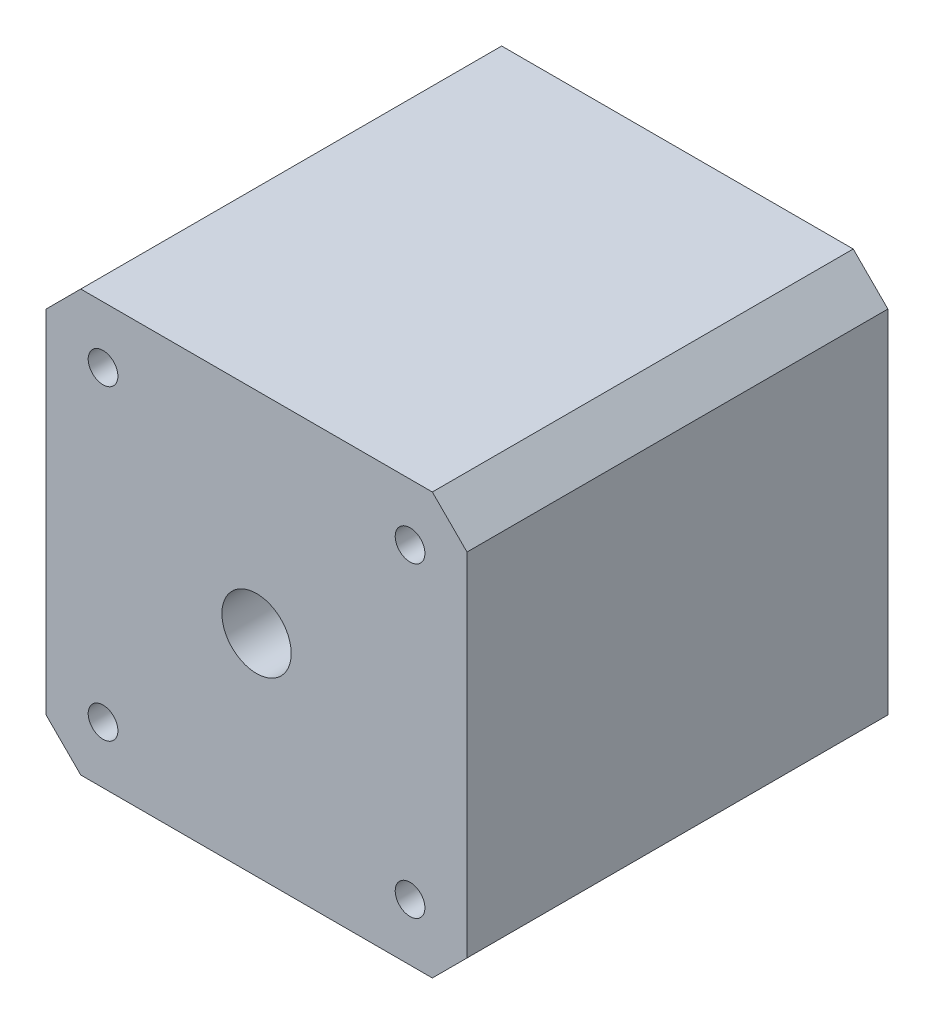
ISO-10303-21;
HEADER;
FILE_DESCRIPTION(('STEP AP214'),'2;1');
FILE_NAME('part.step','',(''),(''),'','','');
FILE_SCHEMA(('AUTOMOTIVE_DESIGN { 1 0 10303 214 1 1 1 1 }'));
ENDSEC;
DATA;
#1=APPLICATION_CONTEXT('core data for automotive mechanical design processes');
#2=APPLICATION_PROTOCOL_DEFINITION('international standard','automotive_design',2000,#1);
#3=PRODUCT_CONTEXT('',#1,'mechanical');
#4=PRODUCT('Part','Part','',(#3));
#5=PRODUCT_RELATED_PRODUCT_CATEGORY('part','',(#4));
#6=PRODUCT_DEFINITION_FORMATION('','',#4);
#7=PRODUCT_DEFINITION_CONTEXT('part definition',#1,'design');
#8=PRODUCT_DEFINITION('design','',#6,#7);
#9=PRODUCT_DEFINITION_SHAPE('','',#8);
#10=(LENGTH_UNIT() NAMED_UNIT(*) SI_UNIT(.MILLI.,.METRE.));
#11=(NAMED_UNIT(*) PLANE_ANGLE_UNIT() SI_UNIT($,.RADIAN.));
#12=(NAMED_UNIT(*) SI_UNIT($,.STERADIAN.) SOLID_ANGLE_UNIT());
#13=UNCERTAINTY_MEASURE_WITH_UNIT(LENGTH_MEASURE(1.E-05),#10,'distance_accuracy_value','');
#14=(GEOMETRIC_REPRESENTATION_CONTEXT(3) GLOBAL_UNCERTAINTY_ASSIGNED_CONTEXT((#13)) GLOBAL_UNIT_ASSIGNED_CONTEXT((#10,
#11,#12)) REPRESENTATION_CONTEXT('',''));
#15=CARTESIAN_POINT('',(0.,0.,0.));
#16=DIRECTION('',(0.,0.,1.));
#17=DIRECTION('',(1.,0.,0.));
#18=AXIS2_PLACEMENT_3D('',#15,#16,#17);
#19=CARTESIAN_POINT('',(21.25,17.75,42.5));
#20=DIRECTION('',(-0.707106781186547,-0.707106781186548,0.));
#21=DIRECTION('',(0.707106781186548,-0.707106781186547,0.));
#22=AXIS2_PLACEMENT_3D('',#19,#20,#21);
#23=PLANE('',#22);
#24=DIRECTION('',(-0.707106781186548,0.707106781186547,0.));
#25=VECTOR('',#24,1.);
#26=CARTESIAN_POINT('',(21.25,17.75,0.));
#27=LINE('',#26,#25);
#28=CARTESIAN_POINT('',(21.25,17.75,0.));
#29=VERTEX_POINT('',#28);
#30=CARTESIAN_POINT('',(17.75,21.25,0.));
#31=VERTEX_POINT('',#30);
#32=EDGE_CURVE('E129',#29,#31,#27,.T.);
#33=ORIENTED_EDGE('',*,*,#32,.T.);
#34=DIRECTION('',(0.,0.,-1.));
#35=VECTOR('',#34,1.);
#36=CARTESIAN_POINT('',(17.75,21.25,42.5));
#37=LINE('',#36,#35);
#38=CARTESIAN_POINT('',(17.75,21.25,42.5));
#39=VERTEX_POINT('',#38);
#40=EDGE_CURVE('E11',#39,#31,#37,.T.);
#41=ORIENTED_EDGE('',*,*,#40,.F.);
#42=DIRECTION('',(-0.707106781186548,0.707106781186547,0.));
#43=VECTOR('',#42,1.);
#44=CARTESIAN_POINT('',(21.25,17.75,42.5));
#45=LINE('',#44,#43);
#46=CARTESIAN_POINT('',(21.25,17.75,42.5));
#47=VERTEX_POINT('',#46);
#48=EDGE_CURVE('E144',#47,#39,#45,.T.);
#49=ORIENTED_EDGE('',*,*,#48,.F.);
#50=DIRECTION('',(0.,0.,-1.));
#51=VECTOR('',#50,1.);
#52=CARTESIAN_POINT('',(21.25,17.75,42.5));
#53=LINE('',#52,#51);
#54=EDGE_CURVE('E125',#47,#29,#53,.T.);
#55=ORIENTED_EDGE('',*,*,#54,.T.);
#56=EDGE_LOOP('',(#33,#41,#49,#55));
#57=FACE_BOUND('',#56,.T.);
#58=ADVANCED_FACE('F33',(#57),#23,.F.);
#59=CARTESIAN_POINT('',(17.75,21.25,42.5));
#60=DIRECTION('',(0.,-1.,0.));
#61=DIRECTION('',(0.,0.,-1.));
#62=AXIS2_PLACEMENT_3D('',#59,#60,#61);
#63=PLANE('',#62);
#64=DIRECTION('',(-1.,0.,0.));
#65=VECTOR('',#64,1.);
#66=CARTESIAN_POINT('',(17.75,21.25,0.));
#67=LINE('',#66,#65);
#68=CARTESIAN_POINT('',(-17.75,21.25,0.));
#69=VERTEX_POINT('',#68);
#70=EDGE_CURVE('E132',#31,#69,#67,.T.);
#71=ORIENTED_EDGE('',*,*,#70,.T.);
#72=DIRECTION('',(0.,0.,-1.));
#73=VECTOR('',#72,1.);
#74=CARTESIAN_POINT('',(-17.75,21.25,42.5));
#75=LINE('',#74,#73);
#76=CARTESIAN_POINT('',(-17.75,21.25,42.5));
#77=VERTEX_POINT('',#76);
#78=EDGE_CURVE('E41',#77,#69,#75,.T.);
#79=ORIENTED_EDGE('',*,*,#78,.F.);
#80=DIRECTION('',(-1.,0.,0.));
#81=VECTOR('',#80,1.);
#82=CARTESIAN_POINT('',(17.75,21.25,42.5));
#83=LINE('',#82,#81);
#84=EDGE_CURVE('E92',#39,#77,#83,.T.);
#85=ORIENTED_EDGE('',*,*,#84,.F.);
#86=ORIENTED_EDGE('',*,*,#40,.T.);
#87=EDGE_LOOP('',(#71,#79,#85,#86));
#88=FACE_BOUND('',#87,.T.);
#89=ADVANCED_FACE('F241',(#88),#63,.F.);
#90=CARTESIAN_POINT('',(-21.25,17.75,42.5));
#91=DIRECTION('',(0.707106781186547,-0.707106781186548,0.));
#92=DIRECTION('',(0.707106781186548,0.707106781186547,0.));
#93=AXIS2_PLACEMENT_3D('',#90,#91,#92);
#94=PLANE('',#93);
#95=DIRECTION('',(-0.707106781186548,-0.707106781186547,0.));
#96=VECTOR('',#95,1.);
#97=CARTESIAN_POINT('',(-21.25,17.75,0.));
#98=LINE('',#97,#96);
#99=CARTESIAN_POINT('',(-21.25,17.75,0.));
#100=VERTEX_POINT('',#99);
#101=EDGE_CURVE('E135',#69,#100,#98,.T.);
#102=ORIENTED_EDGE('',*,*,#101,.T.);
#103=DIRECTION('',(0.,0.,-1.));
#104=VECTOR('',#103,1.);
#105=CARTESIAN_POINT('',(-21.25,17.75,42.5));
#106=LINE('',#105,#104);
#107=CARTESIAN_POINT('',(-21.25,17.75,42.5));
#108=VERTEX_POINT('',#107);
#109=EDGE_CURVE('E151',#108,#100,#106,.T.);
#110=ORIENTED_EDGE('',*,*,#109,.F.);
#111=DIRECTION('',(-0.707106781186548,-0.707106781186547,0.));
#112=VECTOR('',#111,1.);
#113=CARTESIAN_POINT('',(-21.25,17.75,42.5));
#114=LINE('',#113,#112);
#115=EDGE_CURVE('E159',#77,#108,#114,.T.);
#116=ORIENTED_EDGE('',*,*,#115,.F.);
#117=ORIENTED_EDGE('',*,*,#78,.T.);
#118=EDGE_LOOP('',(#102,#110,#116,#117));
#119=FACE_BOUND('',#118,.T.);
#120=ADVANCED_FACE('F157',(#119),#94,.F.);
#121=CARTESIAN_POINT('',(-21.25,-17.75,42.5));
#122=DIRECTION('',(1.,0.,0.));
#123=DIRECTION('',(0.,1.,0.));
#124=AXIS2_PLACEMENT_3D('',#121,#122,#123);
#125=PLANE('',#124);
#126=DIRECTION('',(0.,-1.,0.));
#127=VECTOR('',#126,1.);
#128=CARTESIAN_POINT('',(-21.25,-17.75,0.));
#129=LINE('',#128,#127);
#130=CARTESIAN_POINT('',(-21.25,-17.75,0.));
#131=VERTEX_POINT('',#130);
#132=EDGE_CURVE('E137',#100,#131,#129,.T.);
#133=ORIENTED_EDGE('',*,*,#132,.T.);
#134=DIRECTION('',(0.,0.,-1.));
#135=VECTOR('',#134,1.);
#136=CARTESIAN_POINT('',(-21.25,-17.75,42.5));
#137=LINE('',#136,#135);
#138=CARTESIAN_POINT('',(-21.25,-17.75,42.5));
#139=VERTEX_POINT('',#138);
#140=EDGE_CURVE('E148',#139,#131,#137,.T.);
#141=ORIENTED_EDGE('',*,*,#140,.F.);
#142=DIRECTION('',(0.,-1.,0.));
#143=VECTOR('',#142,1.);
#144=CARTESIAN_POINT('',(-21.25,-17.75,42.5));
#145=LINE('',#144,#143);
#146=EDGE_CURVE('E171',#108,#139,#145,.T.);
#147=ORIENTED_EDGE('',*,*,#146,.F.);
#148=ORIENTED_EDGE('',*,*,#109,.T.);
#149=EDGE_LOOP('',(#133,#141,#147,#148));
#150=FACE_BOUND('',#149,.T.);
#151=ADVANCED_FACE('F167',(#150),#125,.F.);
#152=CARTESIAN_POINT('',(-21.25,-17.75,42.5));
#153=DIRECTION('',(0.707106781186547,0.707106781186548,0.));
#154=DIRECTION('',(-0.707106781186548,0.707106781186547,0.));
#155=AXIS2_PLACEMENT_3D('',#152,#153,#154);
#156=PLANE('',#155);
#157=DIRECTION('',(0.707106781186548,-0.707106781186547,0.));
#158=VECTOR('',#157,1.);
#159=CARTESIAN_POINT('',(-21.25,-17.75,0.));
#160=LINE('',#159,#158);
#161=CARTESIAN_POINT('',(-17.75,-21.25,0.));
#162=VERTEX_POINT('',#161);
#163=EDGE_CURVE('E139',#131,#162,#160,.T.);
#164=ORIENTED_EDGE('',*,*,#163,.T.);
#165=DIRECTION('',(0.,0.,-1.));
#166=VECTOR('',#165,1.);
#167=CARTESIAN_POINT('',(-17.75,-21.25,42.5));
#168=LINE('',#167,#166);
#169=CARTESIAN_POINT('',(-17.75,-21.25,42.5));
#170=VERTEX_POINT('',#169);
#171=EDGE_CURVE('E120',#170,#162,#168,.T.);
#172=ORIENTED_EDGE('',*,*,#171,.F.);
#173=DIRECTION('',(0.707106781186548,-0.707106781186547,0.));
#174=VECTOR('',#173,1.);
#175=CARTESIAN_POINT('',(-21.25,-17.75,42.5));
#176=LINE('',#175,#174);
#177=EDGE_CURVE('E111',#139,#170,#176,.T.);
#178=ORIENTED_EDGE('',*,*,#177,.F.);
#179=ORIENTED_EDGE('',*,*,#140,.T.);
#180=EDGE_LOOP('',(#164,#172,#178,#179));
#181=FACE_BOUND('',#180,.T.);
#182=ADVANCED_FACE('F170',(#181),#156,.F.);
#183=CARTESIAN_POINT('',(17.75,-21.25,42.5));
#184=DIRECTION('',(0.,1.,0.));
#185=DIRECTION('',(-1.,0.,0.));
#186=AXIS2_PLACEMENT_3D('',#183,#184,#185);
#187=PLANE('',#186);
#188=DIRECTION('',(1.,0.,0.));
#189=VECTOR('',#188,1.);
#190=CARTESIAN_POINT('',(17.75,-21.25,0.));
#191=LINE('',#190,#189);
#192=CARTESIAN_POINT('',(17.75,-21.25,0.));
#193=VERTEX_POINT('',#192);
#194=EDGE_CURVE('E119',#162,#193,#191,.T.);
#195=ORIENTED_EDGE('',*,*,#194,.T.);
#196=DIRECTION('',(0.,0.,-1.));
#197=VECTOR('',#196,1.);
#198=CARTESIAN_POINT('',(17.75,-21.25,42.5));
#199=LINE('',#198,#197);
#200=CARTESIAN_POINT('',(17.75,-21.25,42.5));
#201=VERTEX_POINT('',#200);
#202=EDGE_CURVE('E116',#201,#193,#199,.T.);
#203=ORIENTED_EDGE('',*,*,#202,.F.);
#204=DIRECTION('',(1.,0.,0.));
#205=VECTOR('',#204,1.);
#206=CARTESIAN_POINT('',(17.75,-21.25,42.5));
#207=LINE('',#206,#205);
#208=EDGE_CURVE('E105',#170,#201,#207,.T.);
#209=ORIENTED_EDGE('',*,*,#208,.F.);
#210=ORIENTED_EDGE('',*,*,#171,.T.);
#211=EDGE_LOOP('',(#195,#203,#209,#210));
#212=FACE_BOUND('',#211,.T.);
#213=ADVANCED_FACE('F117',(#212),#187,.F.);
#214=CARTESIAN_POINT('',(21.25,-17.75,42.5));
#215=DIRECTION('',(-0.707106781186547,0.707106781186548,0.));
#216=DIRECTION('',(-0.707106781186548,-0.707106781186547,0.));
#217=AXIS2_PLACEMENT_3D('',#214,#215,#216);
#218=PLANE('',#217);
#219=DIRECTION('',(0.707106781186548,0.707106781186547,0.));
#220=VECTOR('',#219,1.);
#221=CARTESIAN_POINT('',(21.25,-17.75,0.));
#222=LINE('',#221,#220);
#223=CARTESIAN_POINT('',(21.25,-17.75,0.));
#224=VERTEX_POINT('',#223);
#225=EDGE_CURVE('E78',#193,#224,#222,.T.);
#226=ORIENTED_EDGE('',*,*,#225,.T.);
#227=DIRECTION('',(0.,0.,-1.));
#228=VECTOR('',#227,1.);
#229=CARTESIAN_POINT('',(21.25,-17.75,42.5));
#230=LINE('',#229,#228);
#231=CARTESIAN_POINT('',(21.25,-17.75,42.5));
#232=VERTEX_POINT('',#231);
#233=EDGE_CURVE('E121',#232,#224,#230,.T.);
#234=ORIENTED_EDGE('',*,*,#233,.F.);
#235=DIRECTION('',(0.707106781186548,0.707106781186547,0.));
#236=VECTOR('',#235,1.);
#237=CARTESIAN_POINT('',(21.25,-17.75,42.5));
#238=LINE('',#237,#236);
#239=EDGE_CURVE('E109',#201,#232,#238,.T.);
#240=ORIENTED_EDGE('',*,*,#239,.F.);
#241=ORIENTED_EDGE('',*,*,#202,.T.);
#242=EDGE_LOOP('',(#226,#234,#240,#241));
#243=FACE_BOUND('',#242,.T.);
#244=ADVANCED_FACE('F123',(#243),#218,.F.);
#245=CARTESIAN_POINT('',(21.25,-17.75,42.5));
#246=DIRECTION('',(-1.,0.,0.));
#247=DIRECTION('',(0.,0.,1.));
#248=AXIS2_PLACEMENT_3D('',#245,#246,#247);
#249=PLANE('',#248);
#250=DIRECTION('',(0.,1.,0.));
#251=VECTOR('',#250,1.);
#252=CARTESIAN_POINT('',(21.25,-17.75,0.));
#253=LINE('',#252,#251);
#254=EDGE_CURVE('E84',#224,#29,#253,.T.);
#255=ORIENTED_EDGE('',*,*,#254,.T.);
#256=ORIENTED_EDGE('',*,*,#54,.F.);
#257=DIRECTION('',(0.,1.,0.));
#258=VECTOR('',#257,1.);
#259=CARTESIAN_POINT('',(21.25,-17.75,42.5));
#260=LINE('',#259,#258);
#261=EDGE_CURVE('E49',#232,#47,#260,.T.);
#262=ORIENTED_EDGE('',*,*,#261,.F.);
#263=ORIENTED_EDGE('',*,*,#233,.T.);
#264=EDGE_LOOP('',(#255,#256,#262,#263));
#265=FACE_BOUND('',#264,.T.);
#266=ADVANCED_FACE('F248',(#265),#249,.F.);
#267=CARTESIAN_POINT('',(0.,0.,42.5));
#268=DIRECTION('',(0.,0.,-1.));
#269=DIRECTION('',(-1.,0.,0.));
#270=AXIS2_PLACEMENT_3D('',#267,#268,#269);
#271=PLANE('',#270);
#272=CARTESIAN_POINT('',(-15.5,15.5,42.5));
#273=DIRECTION('',(0.,0.,-1.));
#274=DIRECTION('',(1.,0.,0.));
#275=AXIS2_PLACEMENT_3D('',#272,#273,#274);
#276=CIRCLE('',#275,1.5);
#277=CARTESIAN_POINT('',(-14.,15.5,42.5));
#278=VERTEX_POINT('',#277);
#279=EDGE_CURVE('E198',#278,#278,#276,.T.);
#280=ORIENTED_EDGE('',*,*,#279,.T.);
#281=EDGE_LOOP('',(#280));
#282=FACE_BOUND('',#281,.T.);
#283=CARTESIAN_POINT('',(-15.5000000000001,-15.4999999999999,42.5));
#284=DIRECTION('',(0.,0.,-1.));
#285=DIRECTION('',(0.,1.,0.));
#286=AXIS2_PLACEMENT_3D('',#283,#284,#285);
#287=CIRCLE('',#286,1.5);
#288=CARTESIAN_POINT('',(-15.5,-14.,42.5));
#289=VERTEX_POINT('',#288);
#290=EDGE_CURVE('E192',#289,#289,#287,.T.);
#291=ORIENTED_EDGE('',*,*,#290,.T.);
#292=EDGE_LOOP('',(#291));
#293=FACE_BOUND('',#292,.T.);
#294=CARTESIAN_POINT('',(15.5,-15.5,42.5));
#295=DIRECTION('',(0.,0.,-1.));
#296=DIRECTION('',(-1.,0.,0.));
#297=AXIS2_PLACEMENT_3D('',#294,#295,#296);
#298=CIRCLE('',#297,1.5);
#299=CARTESIAN_POINT('',(14.,-15.5,42.5));
#300=VERTEX_POINT('',#299);
#301=EDGE_CURVE('E189',#300,#300,#298,.T.);
#302=ORIENTED_EDGE('',*,*,#301,.T.);
#303=EDGE_LOOP('',(#302));
#304=FACE_BOUND('',#303,.T.);
#305=CARTESIAN_POINT('',(15.5,15.5,42.5));
#306=DIRECTION('',(0.,0.,-1.));
#307=DIRECTION('',(-1.,0.,0.));
#308=AXIS2_PLACEMENT_3D('',#305,#306,#307);
#309=CIRCLE('',#308,1.5);
#310=CARTESIAN_POINT('',(14.,15.5,42.5));
#311=VERTEX_POINT('',#310);
#312=EDGE_CURVE('E180',#311,#311,#309,.T.);
#313=ORIENTED_EDGE('',*,*,#312,.T.);
#314=EDGE_LOOP('',(#313));
#315=FACE_BOUND('',#314,.T.);
#316=CARTESIAN_POINT('',(0.,0.,42.5));
#317=DIRECTION('',(0.,0.,-1.));
#318=DIRECTION('',(-1.,0.,0.));
#319=AXIS2_PLACEMENT_3D('',#316,#317,#318);
#320=CIRCLE('',#319,3.5);
#321=CARTESIAN_POINT('',(-3.5,0.,42.5));
#322=VERTEX_POINT('',#321);
#323=EDGE_CURVE('E133',#322,#322,#320,.T.);
#324=ORIENTED_EDGE('',*,*,#323,.T.);
#325=EDGE_LOOP('',(#324));
#326=FACE_BOUND('',#325,.T.);
#327=ORIENTED_EDGE('',*,*,#48,.T.);
#328=ORIENTED_EDGE('',*,*,#84,.T.);
#329=ORIENTED_EDGE('',*,*,#115,.T.);
#330=ORIENTED_EDGE('',*,*,#146,.T.);
#331=ORIENTED_EDGE('',*,*,#177,.T.);
#332=ORIENTED_EDGE('',*,*,#208,.T.);
#333=ORIENTED_EDGE('',*,*,#239,.T.);
#334=ORIENTED_EDGE('',*,*,#261,.T.);
#335=EDGE_LOOP('',(#327,#328,#329,#330,#331,#332,#333,#334));
#336=FACE_BOUND('',#335,.T.);
#337=ADVANCED_FACE('F107',(#282,#293,#304,#315,#326,#336),#271,.F.);
#338=CARTESIAN_POINT('',(0.,0.,0.));
#339=DIRECTION('',(0.,0.,-1.));
#340=DIRECTION('',(-1.,0.,0.));
#341=AXIS2_PLACEMENT_3D('',#338,#339,#340);
#342=PLANE('',#341);
#343=CARTESIAN_POINT('',(-15.5,15.5,0.));
#344=DIRECTION('',(0.,0.,-1.));
#345=DIRECTION('',(1.,0.,0.));
#346=AXIS2_PLACEMENT_3D('',#343,#344,#345);
#347=CIRCLE('',#346,1.5);
#348=CARTESIAN_POINT('',(-14.,15.5,0.));
#349=VERTEX_POINT('',#348);
#350=EDGE_CURVE('E201',#349,#349,#347,.T.);
#351=ORIENTED_EDGE('',*,*,#350,.F.);
#352=EDGE_LOOP('',(#351));
#353=FACE_BOUND('',#352,.T.);
#354=CARTESIAN_POINT('',(-15.5000000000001,-15.4999999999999,0.));
#355=DIRECTION('',(0.,0.,-1.));
#356=DIRECTION('',(0.,1.,0.));
#357=AXIS2_PLACEMENT_3D('',#354,#355,#356);
#358=CIRCLE('',#357,1.5);
#359=CARTESIAN_POINT('',(-15.5,-14.,0.));
#360=VERTEX_POINT('',#359);
#361=EDGE_CURVE('E195',#360,#360,#358,.T.);
#362=ORIENTED_EDGE('',*,*,#361,.F.);
#363=EDGE_LOOP('',(#362));
#364=FACE_BOUND('',#363,.T.);
#365=CARTESIAN_POINT('',(15.5,-15.5,0.));
#366=DIRECTION('',(0.,0.,-1.));
#367=DIRECTION('',(-1.,0.,0.));
#368=AXIS2_PLACEMENT_3D('',#365,#366,#367);
#369=CIRCLE('',#368,1.5);
#370=CARTESIAN_POINT('',(14.,-15.5,0.));
#371=VERTEX_POINT('',#370);
#372=EDGE_CURVE('E186',#371,#371,#369,.T.);
#373=ORIENTED_EDGE('',*,*,#372,.F.);
#374=EDGE_LOOP('',(#373));
#375=FACE_BOUND('',#374,.T.);
#376=CARTESIAN_POINT('',(15.5,15.5,0.));
#377=DIRECTION('',(0.,0.,-1.));
#378=DIRECTION('',(-1.,0.,0.));
#379=AXIS2_PLACEMENT_3D('',#376,#377,#378);
#380=CIRCLE('',#379,1.5);
#381=CARTESIAN_POINT('',(14.,15.5,0.));
#382=VERTEX_POINT('',#381);
#383=EDGE_CURVE('E183',#382,#382,#380,.T.);
#384=ORIENTED_EDGE('',*,*,#383,.F.);
#385=EDGE_LOOP('',(#384));
#386=FACE_BOUND('',#385,.T.);
#387=CARTESIAN_POINT('',(0.,0.,0.));
#388=DIRECTION('',(0.,0.,-1.));
#389=DIRECTION('',(-1.,0.,0.));
#390=AXIS2_PLACEMENT_3D('',#387,#388,#389);
#391=CIRCLE('',#390,3.5);
#392=CARTESIAN_POINT('',(-3.5,0.,0.));
#393=VERTEX_POINT('',#392);
#394=EDGE_CURVE('E177',#393,#393,#391,.T.);
#395=ORIENTED_EDGE('',*,*,#394,.F.);
#396=EDGE_LOOP('',(#395));
#397=FACE_BOUND('',#396,.T.);
#398=ORIENTED_EDGE('',*,*,#32,.F.);
#399=ORIENTED_EDGE('',*,*,#254,.F.);
#400=ORIENTED_EDGE('',*,*,#225,.F.);
#401=ORIENTED_EDGE('',*,*,#194,.F.);
#402=ORIENTED_EDGE('',*,*,#163,.F.);
#403=ORIENTED_EDGE('',*,*,#132,.F.);
#404=ORIENTED_EDGE('',*,*,#101,.F.);
#405=ORIENTED_EDGE('',*,*,#70,.F.);
#406=EDGE_LOOP('',(#398,#399,#400,#401,#402,#403,#404,#405));
#407=FACE_BOUND('',#406,.T.);
#408=ADVANCED_FACE('F163',(#353,#364,#375,#386,#397,#407),#342,.T.);
#409=CARTESIAN_POINT('',(0.,0.,42.5));
#410=DIRECTION('',(0.,0.,-1.));
#411=DIRECTION('',(-1.,0.,0.));
#412=AXIS2_PLACEMENT_3D('',#409,#410,#411);
#413=CYLINDRICAL_SURFACE('',#412,3.5);
#414=ORIENTED_EDGE('',*,*,#323,.F.);
#415=EDGE_LOOP('',(#414));
#416=FACE_BOUND('',#415,.T.);
#417=ORIENTED_EDGE('',*,*,#394,.T.);
#418=EDGE_LOOP('',(#417));
#419=FACE_BOUND('',#418,.T.);
#420=ADVANCED_FACE('F218',(#416,#419),#413,.F.);
#421=CARTESIAN_POINT('',(15.5,15.5,42.5));
#422=DIRECTION('',(0.,0.,-1.));
#423=DIRECTION('',(-1.,0.,0.));
#424=AXIS2_PLACEMENT_3D('',#421,#422,#423);
#425=CYLINDRICAL_SURFACE('',#424,1.5);
#426=ORIENTED_EDGE('',*,*,#312,.F.);
#427=EDGE_LOOP('',(#426));
#428=FACE_BOUND('',#427,.T.);
#429=ORIENTED_EDGE('',*,*,#383,.T.);
#430=EDGE_LOOP('',(#429));
#431=FACE_BOUND('',#430,.T.);
#432=ADVANCED_FACE('F229',(#428,#431),#425,.F.);
#433=CARTESIAN_POINT('',(15.5,-15.5,42.5));
#434=DIRECTION('',(0.,0.,-1.));
#435=DIRECTION('',(-1.,0.,0.));
#436=AXIS2_PLACEMENT_3D('',#433,#434,#435);
#437=CYLINDRICAL_SURFACE('',#436,1.5);
#438=ORIENTED_EDGE('',*,*,#301,.F.);
#439=EDGE_LOOP('',(#438));
#440=FACE_BOUND('',#439,.T.);
#441=ORIENTED_EDGE('',*,*,#372,.T.);
#442=EDGE_LOOP('',(#441));
#443=FACE_BOUND('',#442,.T.);
#444=ADVANCED_FACE('F235',(#440,#443),#437,.F.);
#445=CARTESIAN_POINT('',(-15.5000000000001,-15.4999999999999,42.5));
#446=DIRECTION('',(0.,0.,-1.));
#447=DIRECTION('',(-1.,0.,0.));
#448=AXIS2_PLACEMENT_3D('',#445,#446,#447);
#449=CYLINDRICAL_SURFACE('',#448,1.5);
#450=ORIENTED_EDGE('',*,*,#290,.F.);
#451=EDGE_LOOP('',(#450));
#452=FACE_BOUND('',#451,.T.);
#453=ORIENTED_EDGE('',*,*,#361,.T.);
#454=EDGE_LOOP('',(#453));
#455=FACE_BOUND('',#454,.T.);
#456=ADVANCED_FACE('F212',(#452,#455),#449,.F.);
#457=CARTESIAN_POINT('',(-15.5,15.5,42.5));
#458=DIRECTION('',(0.,0.,-1.));
#459=DIRECTION('',(-1.,0.,0.));
#460=AXIS2_PLACEMENT_3D('',#457,#458,#459);
#461=CYLINDRICAL_SURFACE('',#460,1.5);
#462=ORIENTED_EDGE('',*,*,#279,.F.);
#463=EDGE_LOOP('',(#462));
#464=FACE_BOUND('',#463,.T.);
#465=ORIENTED_EDGE('',*,*,#350,.T.);
#466=EDGE_LOOP('',(#465));
#467=FACE_BOUND('',#466,.T.);
#468=ADVANCED_FACE('F209',(#464,#467),#461,.F.);
#469=CLOSED_SHELL('',(#58,#89,#120,#151,#182,#213,#244,#266,#337,#408,#420,#432,#444,#456,#468));
#470=MANIFOLD_SOLID_BREP('B2',#469);
#471=ADVANCED_BREP_SHAPE_REPRESENTATION('',(#18,#470),#14);
#472=SHAPE_DEFINITION_REPRESENTATION(#9,#471);
ENDSEC;
END-ISO-10303-21;
